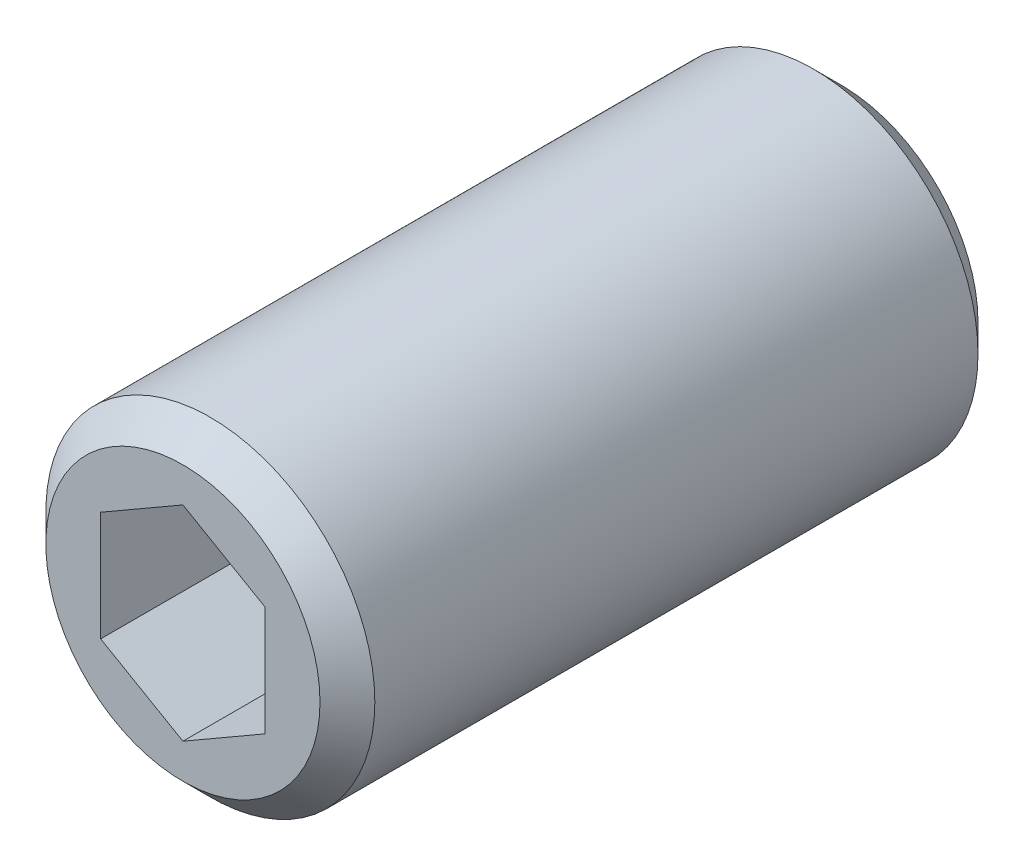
from build123d import *

# Parameters (mm, degrees)
ESQUISSE1_R             = 3
BASE_EXTRUSION_DEPTH    = 12
CHANFREIN1_SIZE         = 0.5
ENL_V_MAT_EXTRU_1_DEPTH = 4


with BuildPart() as part:
    # Esquisse1 → Base-Extrusion (new body)
    with BuildSketch(Plane.XY):
        Circle(ESQUISSE1_R)
    extrude(amount=BASE_EXTRUSION_DEPTH)

    # Chanfrein1
    chanfrein1_edges = [part.edges().sort_by_distance(p)[0] for p in [
        (-3, 0, 0),
        (-3, 0, 12),
    ]]
    chamfer(chanfrein1_edges, length=CHANFREIN1_SIZE)

    # Esquisse2 → Enl_v. mat.-Extru.1 (cut)
    with BuildSketch(Plane.XY.offset(12)):
        Polygon((-1.5, 1), (-1.5, -1), (0, -1.866025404), (1.5, -1), (1.5, 1), (0, 1.866025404), align=None)
    extrude(amount=-ENL_V_MAT_EXTRU_1_DEPTH, mode=Mode.SUBTRACT)


solid = part.part
